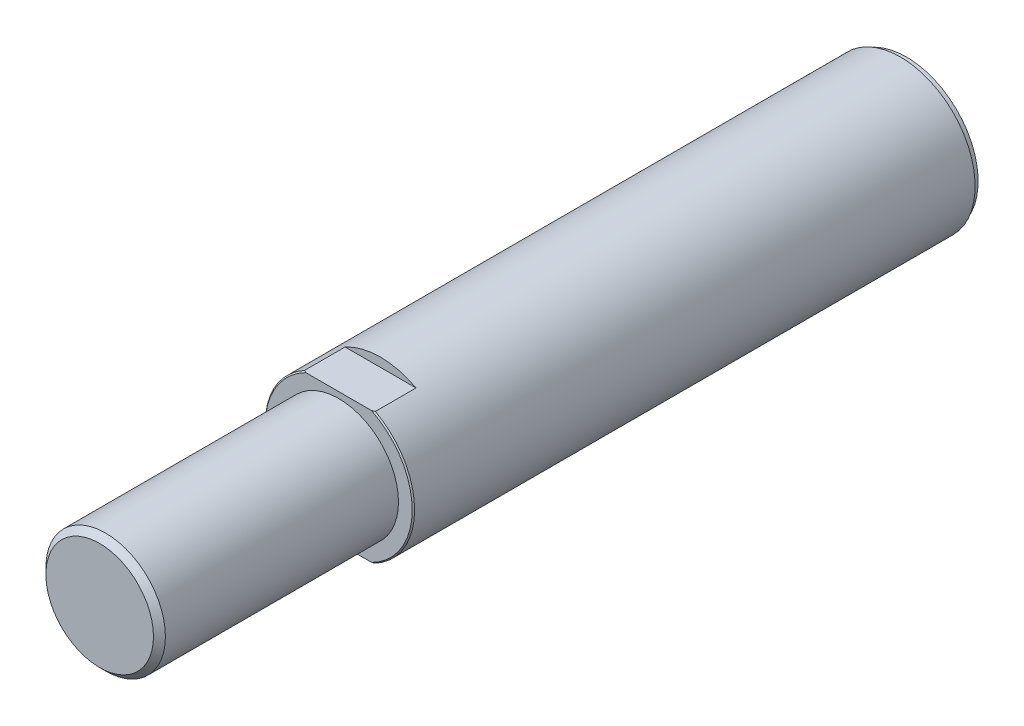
ISO-10303-21;
HEADER;
FILE_DESCRIPTION(('STEP AP214'),'2;1');
FILE_NAME('part.step','',(''),(''),'','','');
FILE_SCHEMA(('AUTOMOTIVE_DESIGN { 1 0 10303 214 1 1 1 1 }'));
ENDSEC;
DATA;
#1=APPLICATION_CONTEXT('core data for automotive mechanical design processes');
#2=APPLICATION_PROTOCOL_DEFINITION('international standard','automotive_design',2000,#1);
#3=PRODUCT_CONTEXT('',#1,'mechanical');
#4=PRODUCT('Part','Part','',(#3));
#5=PRODUCT_RELATED_PRODUCT_CATEGORY('part','',(#4));
#6=PRODUCT_DEFINITION_FORMATION('','',#4);
#7=PRODUCT_DEFINITION_CONTEXT('part definition',#1,'design');
#8=PRODUCT_DEFINITION('design','',#6,#7);
#9=PRODUCT_DEFINITION_SHAPE('','',#8);
#10=(LENGTH_UNIT() NAMED_UNIT(*) SI_UNIT(.MILLI.,.METRE.));
#11=(NAMED_UNIT(*) PLANE_ANGLE_UNIT() SI_UNIT($,.RADIAN.));
#12=(NAMED_UNIT(*) SI_UNIT($,.STERADIAN.) SOLID_ANGLE_UNIT());
#13=UNCERTAINTY_MEASURE_WITH_UNIT(LENGTH_MEASURE(1.E-05),#10,'distance_accuracy_value','');
#14=(GEOMETRIC_REPRESENTATION_CONTEXT(3) GLOBAL_UNCERTAINTY_ASSIGNED_CONTEXT((#13)) GLOBAL_UNIT_ASSIGNED_CONTEXT((#10,
#11,#12)) REPRESENTATION_CONTEXT('',''));
#15=CARTESIAN_POINT('',(0.,0.,0.));
#16=DIRECTION('',(0.,0.,1.));
#17=DIRECTION('',(1.,0.,0.));
#18=AXIS2_PLACEMENT_3D('',#15,#16,#17);
#19=CARTESIAN_POINT('',(0.,0.,135.));
#20=DIRECTION('',(0.,0.,-1.));
#21=DIRECTION('',(-1.,0.,0.));
#22=AXIS2_PLACEMENT_3D('',#19,#20,#21);
#23=CYLINDRICAL_SURFACE('',#22,12.5);
#24=CARTESIAN_POINT('',(0.,0.,1.));
#25=DIRECTION('',(0.,0.,-1.));
#26=DIRECTION('',(-1.,0.,0.));
#27=AXIS2_PLACEMENT_3D('',#24,#25,#26);
#28=CIRCLE('',#27,12.5);
#29=CARTESIAN_POINT('',(-12.5,0.,1.));
#30=VERTEX_POINT('',#29);
#31=EDGE_CURVE('E128',#30,#30,#28,.T.);
#32=ORIENTED_EDGE('',*,*,#31,.F.);
#33=EDGE_LOOP('',(#32));
#34=FACE_BOUND('',#33,.T.);
#35=DIRECTION('',(0.,0.,-1.));
#36=VECTOR('',#35,1.);
#37=CARTESIAN_POINT('',(-5.93717104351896,-11.,135.));
#38=LINE('',#37,#36);
#39=CARTESIAN_POINT('',(-5.93717104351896,-11.,94.8));
#40=VERTEX_POINT('',#39);
#41=CARTESIAN_POINT('',(-5.93717104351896,-11.,88.));
#42=VERTEX_POINT('',#41);
#43=EDGE_CURVE('E199',#40,#42,#38,.T.);
#44=ORIENTED_EDGE('',*,*,#43,.F.);
#45=CARTESIAN_POINT('',(0.,0.,94.8));
#46=DIRECTION('',(0.,0.,1.));
#47=DIRECTION('',(1.,0.,0.));
#48=AXIS2_PLACEMENT_3D('',#45,#46,#47);
#49=CIRCLE('',#48,12.5);
#50=CARTESIAN_POINT('',(-5.93717104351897,11.,94.8));
#51=VERTEX_POINT('',#50);
#52=EDGE_CURVE('E130',#40,#51,#49,.F.);
#53=ORIENTED_EDGE('',*,*,#52,.T.);
#54=DIRECTION('',(0.,0.,-1.));
#55=VECTOR('',#54,1.);
#56=CARTESIAN_POINT('',(-5.93717104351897,11.,135.));
#57=LINE('',#56,#55);
#58=CARTESIAN_POINT('',(-5.93717104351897,11.,88.));
#59=VERTEX_POINT('',#58);
#60=EDGE_CURVE('E57',#59,#51,#57,.F.);
#61=ORIENTED_EDGE('',*,*,#60,.F.);
#62=CARTESIAN_POINT('',(0.,0.,88.));
#63=DIRECTION('',(0.,0.,1.));
#64=DIRECTION('',(1.,0.,0.));
#65=AXIS2_PLACEMENT_3D('',#62,#63,#64);
#66=CIRCLE('',#65,12.5);
#67=CARTESIAN_POINT('',(5.93717104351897,11.,88.));
#68=VERTEX_POINT('',#67);
#69=EDGE_CURVE('E46',#68,#59,#66,.T.);
#70=ORIENTED_EDGE('',*,*,#69,.F.);
#71=DIRECTION('',(0.,0.,-1.));
#72=VECTOR('',#71,1.);
#73=CARTESIAN_POINT('',(5.93717104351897,11.,135.));
#74=LINE('',#73,#72);
#75=CARTESIAN_POINT('',(5.93717104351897,11.,94.8));
#76=VERTEX_POINT('',#75);
#77=EDGE_CURVE('E208',#76,#68,#74,.T.);
#78=ORIENTED_EDGE('',*,*,#77,.F.);
#79=CARTESIAN_POINT('',(5.93717104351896,-11.,94.8));
#80=VERTEX_POINT('',#79);
#81=EDGE_CURVE('E115',#76,#80,#49,.F.);
#82=ORIENTED_EDGE('',*,*,#81,.T.);
#83=DIRECTION('',(0.,0.,-1.));
#84=VECTOR('',#83,1.);
#85=CARTESIAN_POINT('',(5.93717104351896,-11.,135.));
#86=LINE('',#85,#84);
#87=CARTESIAN_POINT('',(5.93717104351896,-11.,88.));
#88=VERTEX_POINT('',#87);
#89=EDGE_CURVE('E65',#88,#80,#86,.F.);
#90=ORIENTED_EDGE('',*,*,#89,.F.);
#91=EDGE_CURVE('E12',#42,#88,#66,.T.);
#92=ORIENTED_EDGE('',*,*,#91,.F.);
#93=EDGE_LOOP('',(#44,#53,#61,#70,#78,#82,#90,#92));
#94=FACE_BOUND('',#93,.T.);
#95=ADVANCED_FACE('F42',(#34,#94),#23,.T.);
#96=CARTESIAN_POINT('',(0.,0.,95.));
#97=DIRECTION('',(0.,0.,1.));
#98=DIRECTION('',(1.,0.,0.));
#99=AXIS2_PLACEMENT_3D('',#96,#97,#98);
#100=PLANE('',#99);
#101=CARTESIAN_POINT('',(0.,0.,95.));
#102=DIRECTION('',(0.,0.,1.));
#103=DIRECTION('',(1.,0.,0.));
#104=AXIS2_PLACEMENT_3D('',#101,#102,#103);
#105=CIRCLE('',#104,10.);
#106=CARTESIAN_POINT('',(10.,0.,95.));
#107=VERTEX_POINT('',#106);
#108=EDGE_CURVE('E121',#107,#107,#105,.T.);
#109=ORIENTED_EDGE('',*,*,#108,.F.);
#110=EDGE_LOOP('',(#109));
#111=FACE_BOUND('',#110,.T.);
#112=CARTESIAN_POINT('',(0.,0.,95.));
#113=DIRECTION('',(0.,0.,1.));
#114=DIRECTION('',(1.,0.,0.));
#115=AXIS2_PLACEMENT_3D('',#112,#113,#114);
#116=CIRCLE('',#115,12.3);
#117=CARTESIAN_POINT('',(-5.50363516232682,11.,95.));
#118=VERTEX_POINT('',#117);
#119=CARTESIAN_POINT('',(-5.50363516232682,-11.,95.));
#120=VERTEX_POINT('',#119);
#121=EDGE_CURVE('E120',#118,#120,#116,.T.);
#122=ORIENTED_EDGE('',*,*,#121,.T.);
#123=DIRECTION('',(1.,0.,0.));
#124=VECTOR('',#123,1.);
#125=CARTESIAN_POINT('',(-21.0914396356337,-11.,95.));
#126=LINE('',#125,#124);
#127=CARTESIAN_POINT('',(5.50363516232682,-11.,95.));
#128=VERTEX_POINT('',#127);
#129=EDGE_CURVE('E107',#120,#128,#126,.T.);
#130=ORIENTED_EDGE('',*,*,#129,.T.);
#131=CARTESIAN_POINT('',(5.50363516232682,11.,95.));
#132=VERTEX_POINT('',#131);
#133=EDGE_CURVE('E113',#128,#132,#116,.T.);
#134=ORIENTED_EDGE('',*,*,#133,.T.);
#135=DIRECTION('',(-1.,0.,0.));
#136=VECTOR('',#135,1.);
#137=CARTESIAN_POINT('',(-21.0914396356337,11.,95.));
#138=LINE('',#137,#136);
#139=EDGE_CURVE('E97',#132,#118,#138,.T.);
#140=ORIENTED_EDGE('',*,*,#139,.T.);
#141=EDGE_LOOP('',(#122,#130,#134,#140));
#142=FACE_BOUND('',#141,.T.);
#143=ADVANCED_FACE('F119',(#111,#142),#100,.T.);
#144=CARTESIAN_POINT('',(0.,0.,95.));
#145=DIRECTION('',(0.,0.,-1.));
#146=DIRECTION('',(-1.,0.,0.));
#147=AXIS2_PLACEMENT_3D('',#144,#145,#146);
#148=CONICAL_SURFACE('',#147,12.3,0.785398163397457);
#149=ORIENTED_EDGE('',*,*,#52,.F.);
#150=CARTESIAN_POINT('',(-25.2049082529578,-11.,79.7993200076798));
#151=CARTESIAN_POINT('',(-24.8332961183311,-11.,80.1398994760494));
#152=CARTESIAN_POINT('',(-24.4610927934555,-11.,80.4798355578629));
#153=CARTESIAN_POINT('',(-23.7153278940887,-11.,81.1582204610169));
#154=CARTESIAN_POINT('',(-23.3417663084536,-11.,81.4966692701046));
#155=CARTESIAN_POINT('',(-22.5930262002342,-11.,82.1719537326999));
#156=CARTESIAN_POINT('',(-22.2178473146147,-11.,82.5087889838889));
#157=CARTESIAN_POINT('',(-21.4657494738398,-11.,83.1805104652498));
#158=CARTESIAN_POINT('',(-21.0888305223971,-11.,83.5153966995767));
#159=CARTESIAN_POINT('',(-20.3305063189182,-11.,84.185120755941));
#160=CARTESIAN_POINT('',(-19.9490878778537,-11.,84.5199436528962));
#161=CARTESIAN_POINT('',(-19.1839299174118,-11.,85.1869267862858));
#162=CARTESIAN_POINT('',(-18.8001904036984,-11.,85.5190870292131));
#163=CARTESIAN_POINT('',(-18.0300668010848,-11.,86.1802387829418));
#164=CARTESIAN_POINT('',(-17.6436830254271,-11.,86.509230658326));
#165=CARTESIAN_POINT('',(-16.8677829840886,-11.,87.1635010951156));
#166=CARTESIAN_POINT('',(-16.4782667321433,-11.,87.4887796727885));
#167=CARTESIAN_POINT('',(-15.7614675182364,-11.,88.0804751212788));
#168=CARTESIAN_POINT('',(-15.4347519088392,-11.,88.3475789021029));
#169=CARTESIAN_POINT('',(-14.7783997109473,-11.,88.878171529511));
#170=CARTESIAN_POINT('',(-14.4487631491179,-11.,89.1416604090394));
#171=CARTESIAN_POINT('',(-13.7860202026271,-11.,89.6644435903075));
#172=CARTESIAN_POINT('',(-13.4529128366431,-11.,89.9237366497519));
#173=CARTESIAN_POINT('',(-12.7827870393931,-11.,90.4372220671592));
#174=CARTESIAN_POINT('',(-12.4457686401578,-11.,90.6914144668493));
#175=CARTESIAN_POINT('',(-11.7675925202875,-11.,91.1933465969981));
#176=CARTESIAN_POINT('',(-11.4264404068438,-11.,91.4410938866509));
#177=CARTESIAN_POINT('',(-10.738811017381,-11.,91.9291387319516));
#178=CARTESIAN_POINT('',(-10.3923335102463,-11.,92.1694359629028));
#179=CARTESIAN_POINT('',(-9.69333013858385,-11.,92.6407355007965));
#180=CARTESIAN_POINT('',(-9.34080722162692,-11.,92.8717421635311));
#181=CARTESIAN_POINT('',(-8.6285494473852,-11.,93.3223116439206));
#182=CARTESIAN_POINT('',(-8.26881550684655,-11.,93.5418759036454));
#183=CARTESIAN_POINT('',(-7.54622405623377,-11.,93.9635589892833));
#184=CARTESIAN_POINT('',(-7.1834883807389,-11.,94.1658853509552));
#185=CARTESIAN_POINT('',(-6.4486276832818,-11.,94.5529518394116));
#186=CARTESIAN_POINT('',(-6.07650171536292,-11.,94.7376901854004));
#187=CARTESIAN_POINT('',(-5.32234700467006,-11.,95.0846232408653));
#188=CARTESIAN_POINT('',(-4.94033118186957,-11.,95.2468457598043));
#189=CARTESIAN_POINT('',(-4.16548005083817,-11.,95.5431605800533));
#190=CARTESIAN_POINT('',(-3.77264786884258,-11.,95.6772609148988));
#191=CARTESIAN_POINT('',(-3.05749092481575,-11.,95.8870100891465));
#192=CARTESIAN_POINT('',(-2.73703620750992,-11.,95.9689982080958));
#193=CARTESIAN_POINT('',(-2.09063675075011,-11.,96.1075378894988));
#194=CARTESIAN_POINT('',(-1.76469277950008,-11.,96.1640929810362));
#195=CARTESIAN_POINT('',(-1.10994339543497,-11.,96.2488943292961));
#196=CARTESIAN_POINT('',(-0.781147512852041,-11.,96.2772131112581));
#197=CARTESIAN_POINT('',(-0.122326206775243,-11.,96.3042432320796));
#198=CARTESIAN_POINT('',(0.207699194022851,-11.,96.3029551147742));
#199=CARTESIAN_POINT('',(0.866187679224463,-11.,96.2708506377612));
#200=CARTESIAN_POINT('',(1.19465120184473,-11.,96.2400431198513));
#201=CARTESIAN_POINT('',(1.8477342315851,-11.,96.1505870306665));
#202=CARTESIAN_POINT('',(2.17235340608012,-11.,96.0919360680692));
#203=CARTESIAN_POINT('',(2.81692746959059,-11.,95.9494087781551));
#204=CARTESIAN_POINT('',(3.13686596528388,-11.,95.8654592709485));
#205=CARTESIAN_POINT('',(3.77013120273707,-11.,95.6757764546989));
#206=CARTESIAN_POINT('',(4.08345803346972,-11.,95.5700434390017));
#207=CARTESIAN_POINT('',(4.77959899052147,-11.,95.3118471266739));
#208=CARTESIAN_POINT('',(5.16051287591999,-11.,95.1542887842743));
#209=CARTESIAN_POINT('',(5.9121721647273,-11.,94.8163719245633));
#210=CARTESIAN_POINT('',(6.28291247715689,-11.,94.636002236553));
#211=CARTESIAN_POINT('',(7.01572159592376,-11.,94.2569234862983));
#212=CARTESIAN_POINT('',(7.37777248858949,-11.,94.0581800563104));
#213=CARTESIAN_POINT('',(8.09354374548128,-11.,93.6464369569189));
#214=CARTESIAN_POINT('',(8.44726541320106,-11.,93.4334395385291));
#215=CARTESIAN_POINT('',(9.15130038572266,-11.,92.9937098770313));
#216=CARTESIAN_POINT('',(9.50153682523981,-11.,92.7668551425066));
#217=CARTESIAN_POINT('',(10.1957742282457,-11.,92.3037685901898));
#218=CARTESIAN_POINT('',(10.5397746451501,-11.,92.0675359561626));
#219=CARTESIAN_POINT('',(11.2225281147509,-11.,91.5873865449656));
#220=CARTESIAN_POINT('',(11.5612793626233,-11.,91.3434672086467));
#221=CARTESIAN_POINT('',(12.2341678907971,-11.,90.8493837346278));
#222=CARTESIAN_POINT('',(12.5683053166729,-11.,90.5992197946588));
#223=CARTESIAN_POINT('',(13.449124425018,-11.,89.928993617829));
#224=CARTESIAN_POINT('',(13.9924028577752,-11.,89.5044606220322));
#225=CARTESIAN_POINT('',(15.0704026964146,-11.,88.6449335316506));
#226=CARTESIAN_POINT('',(15.6051257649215,-11.,88.2099415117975));
#227=CARTESIAN_POINT('',(16.6682135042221,-11.,87.3315328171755));
#228=CARTESIAN_POINT('',(17.196573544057,-11.,86.8881105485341));
#229=CARTESIAN_POINT('',(18.2478896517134,-11.,85.9948668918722));
#230=CARTESIAN_POINT('',(18.7708454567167,-11.,85.5450451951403));
#231=CARTESIAN_POINT('',(19.7911752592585,-11.,84.6586787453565));
#232=CARTESIAN_POINT('',(20.2887256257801,-11.,84.222336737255));
#233=CARTESIAN_POINT('',(21.2804238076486,-11.,83.3458210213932));
#234=CARTESIAN_POINT('',(21.7745716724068,-11.,82.9056473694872));
#235=CARTESIAN_POINT('',(22.7594616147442,-11.,82.0226290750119));
#236=CARTESIAN_POINT('',(23.250206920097,-11.,81.5797880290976));
#237=CARTESIAN_POINT('',(24.2292721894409,-11.,80.6914346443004));
#238=CARTESIAN_POINT('',(24.7175921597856,-11.,80.2459223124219));
#239=CARTESIAN_POINT('',(25.2049082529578,-11.,79.7993200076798));
#240=B_SPLINE_CURVE_WITH_KNOTS('',3,(#150,#151,#152,#153,#154,#155,#156,#157,#158,#159,#160,
#161,#162,#163,#164,#165,#166,#167,#168,#169,#170,#171,#172,#173,#174,#175,#176,#177,#178,#179,
#180,#181,#182,#183,#184,#185,#186,#187,#188,#189,#190,#191,#192,#193,#194,#195,#196,#197,#198,
#199,#200,#201,#202,#203,#204,#205,#206,#207,#208,#209,#210,#211,#212,#213,#214,#215,#216,#217,
#218,#219,#220,#221,#222,#223,#224,#225,#226,#227,#228,#229,#230,#231,#232,#233,#234,#235,#236,
#237,#238,#239),.UNSPECIFIED.,.F.,.F.,(4,2,2,2,2,2,2,2,2,2,2,2,2,2,2,2,2,2,2,2,2,2,2,2,2,2,2,2,
2,2,2,2,2,2,2,2,2,2,2,2,2,2,2,2,4),(0.,1.51222100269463,3.0244544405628,4.53704712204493,
6.04963657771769,7.57221518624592,9.09479008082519,10.6171876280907,12.1395785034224,
13.4055696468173,14.6715492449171,15.9378970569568,17.2042345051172,18.4690128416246,
19.7338462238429,20.9980795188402,22.2621530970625,23.5078130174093,24.7535989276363,
25.9978321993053,27.2417095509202,28.2331520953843,29.2244570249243,30.213209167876,
31.2019431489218,32.1903810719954,33.178903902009,34.1703140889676,35.1617109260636,
36.3973752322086,37.6336470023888,38.8722798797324,40.1107176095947,41.3623951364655,
42.6141818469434,43.8663898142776,45.1185581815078,47.1867976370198,49.254630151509,
51.3238862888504,53.3932425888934,55.3785544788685,57.3638374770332,59.3468682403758,
61.3298938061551),.UNSPECIFIED.);
#241=EDGE_CURVE('E206',#40,#120,#240,.T.);
#242=ORIENTED_EDGE('',*,*,#241,.T.);
#243=ORIENTED_EDGE('',*,*,#121,.F.);
#244=CARTESIAN_POINT('',(25.2049082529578,11.,79.7993200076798));
#245=CARTESIAN_POINT('',(24.8332961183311,11.,80.1398994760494));
#246=CARTESIAN_POINT('',(24.4610927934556,11.,80.4798355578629));
#247=CARTESIAN_POINT('',(23.7153278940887,11.,81.1582204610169));
#248=CARTESIAN_POINT('',(23.3417663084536,11.,81.4966692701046));
#249=CARTESIAN_POINT('',(22.5930262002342,11.,82.1719537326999));
#250=CARTESIAN_POINT('',(22.2178473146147,11.,82.5087889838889));
#251=CARTESIAN_POINT('',(21.4657494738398,11.,83.1805104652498));
#252=CARTESIAN_POINT('',(21.0888305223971,11.,83.5153966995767));
#253=CARTESIAN_POINT('',(20.3305063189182,11.,84.185120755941));
#254=CARTESIAN_POINT('',(19.9490878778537,11.,84.5199436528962));
#255=CARTESIAN_POINT('',(19.1839299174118,11.,85.1869267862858));
#256=CARTESIAN_POINT('',(18.8001904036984,11.,85.5190870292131));
#257=CARTESIAN_POINT('',(18.0300668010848,11.,86.1802387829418));
#258=CARTESIAN_POINT('',(17.6436830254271,11.,86.509230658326));
#259=CARTESIAN_POINT('',(16.8677829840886,11.,87.1635010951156));
#260=CARTESIAN_POINT('',(16.4782667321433,11.,87.4887796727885));
#261=CARTESIAN_POINT('',(15.7614675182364,11.,88.0804751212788));
#262=CARTESIAN_POINT('',(15.4347519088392,11.,88.3475789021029));
#263=CARTESIAN_POINT('',(14.7783997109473,11.,88.878171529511));
#264=CARTESIAN_POINT('',(14.4487631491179,11.,89.1416604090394));
#265=CARTESIAN_POINT('',(13.7860202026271,11.,89.6644435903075));
#266=CARTESIAN_POINT('',(13.4529128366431,11.,89.9237366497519));
#267=CARTESIAN_POINT('',(12.7827870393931,11.,90.4372220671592));
#268=CARTESIAN_POINT('',(12.4457686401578,11.,90.6914144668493));
#269=CARTESIAN_POINT('',(11.7675925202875,11.,91.1933465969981));
#270=CARTESIAN_POINT('',(11.4264404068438,11.,91.4410938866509));
#271=CARTESIAN_POINT('',(10.738811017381,11.,91.9291387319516));
#272=CARTESIAN_POINT('',(10.3923335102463,11.,92.1694359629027));
#273=CARTESIAN_POINT('',(9.69333013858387,11.,92.6407355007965));
#274=CARTESIAN_POINT('',(9.34080722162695,11.,92.8717421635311));
#275=CARTESIAN_POINT('',(8.62854944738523,11.,93.3223116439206));
#276=CARTESIAN_POINT('',(8.26881550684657,11.,93.5418759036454));
#277=CARTESIAN_POINT('',(7.5462240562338,11.,93.9635589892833));
#278=CARTESIAN_POINT('',(7.18348838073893,11.,94.1658853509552));
#279=CARTESIAN_POINT('',(6.44862768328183,11.,94.5529518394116));
#280=CARTESIAN_POINT('',(6.07650171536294,11.,94.7376901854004));
#281=CARTESIAN_POINT('',(5.32234700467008,11.,95.0846232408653));
#282=CARTESIAN_POINT('',(4.94033118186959,11.,95.2468457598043));
#283=CARTESIAN_POINT('',(4.16548005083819,11.,95.5431605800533));
#284=CARTESIAN_POINT('',(3.77264786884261,11.,95.6772609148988));
#285=CARTESIAN_POINT('',(3.05749092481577,11.,95.8870100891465));
#286=CARTESIAN_POINT('',(2.73703620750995,11.,95.9689982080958));
#287=CARTESIAN_POINT('',(2.09063675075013,11.,96.1075378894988));
#288=CARTESIAN_POINT('',(1.7646927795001,11.,96.1640929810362));
#289=CARTESIAN_POINT('',(1.10994339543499,11.,96.2488943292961));
#290=CARTESIAN_POINT('',(0.781147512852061,11.,96.2772131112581));
#291=CARTESIAN_POINT('',(0.12232620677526,11.,96.3042432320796));
#292=CARTESIAN_POINT('',(-0.207699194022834,11.,96.3029551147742));
#293=CARTESIAN_POINT('',(-0.866187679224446,11.,96.2708506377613));
#294=CARTESIAN_POINT('',(-1.19465120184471,11.,96.2400431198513));
#295=CARTESIAN_POINT('',(-1.84773423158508,11.,96.1505870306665));
#296=CARTESIAN_POINT('',(-2.1723534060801,11.,96.0919360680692));
#297=CARTESIAN_POINT('',(-2.81692746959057,11.,95.9494087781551));
#298=CARTESIAN_POINT('',(-3.13686596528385,11.,95.8654592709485));
#299=CARTESIAN_POINT('',(-3.77013120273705,11.,95.6757764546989));
#300=CARTESIAN_POINT('',(-4.08345803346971,11.,95.5700434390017));
#301=CARTESIAN_POINT('',(-4.77959899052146,11.,95.3118471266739));
#302=CARTESIAN_POINT('',(-5.16051287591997,11.,95.1542887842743));
#303=CARTESIAN_POINT('',(-5.91217216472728,11.,94.8163719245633));
#304=CARTESIAN_POINT('',(-6.28291247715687,11.,94.636002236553));
#305=CARTESIAN_POINT('',(-7.01572159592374,11.,94.2569234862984));
#306=CARTESIAN_POINT('',(-7.37777248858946,11.,94.0581800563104));
#307=CARTESIAN_POINT('',(-8.09354374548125,11.,93.6464369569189));
#308=CARTESIAN_POINT('',(-8.44726541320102,11.,93.4334395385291));
#309=CARTESIAN_POINT('',(-9.15130038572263,11.,92.9937098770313));
#310=CARTESIAN_POINT('',(-9.50153682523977,11.,92.7668551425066));
#311=CARTESIAN_POINT('',(-10.1957742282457,11.,92.3037685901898));
#312=CARTESIAN_POINT('',(-10.5397746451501,11.,92.0675359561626));
#313=CARTESIAN_POINT('',(-11.2225281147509,11.,91.5873865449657));
#314=CARTESIAN_POINT('',(-11.5612793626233,11.,91.3434672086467));
#315=CARTESIAN_POINT('',(-12.2341678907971,11.,90.8493837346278));
#316=CARTESIAN_POINT('',(-12.5683053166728,11.,90.5992197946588));
#317=CARTESIAN_POINT('',(-13.449124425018,11.,89.928993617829));
#318=CARTESIAN_POINT('',(-13.9924028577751,11.,89.5044606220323));
#319=CARTESIAN_POINT('',(-15.0704026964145,11.,88.6449335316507));
#320=CARTESIAN_POINT('',(-15.6051257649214,11.,88.2099415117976));
#321=CARTESIAN_POINT('',(-16.6682135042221,11.,87.3315328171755));
#322=CARTESIAN_POINT('',(-17.196573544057,11.,86.8881105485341));
#323=CARTESIAN_POINT('',(-18.2478896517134,11.,85.9948668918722));
#324=CARTESIAN_POINT('',(-18.7708454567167,11.,85.5450451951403));
#325=CARTESIAN_POINT('',(-19.7911752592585,11.,84.6586787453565));
#326=CARTESIAN_POINT('',(-20.2887256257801,11.,84.222336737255));
#327=CARTESIAN_POINT('',(-21.2804238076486,11.,83.3458210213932));
#328=CARTESIAN_POINT('',(-21.7745716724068,11.,82.9056473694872));
#329=CARTESIAN_POINT('',(-22.7594616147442,11.,82.0226290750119));
#330=CARTESIAN_POINT('',(-23.250206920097,11.,81.5797880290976));
#331=CARTESIAN_POINT('',(-24.2292721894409,11.,80.6914346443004));
#332=CARTESIAN_POINT('',(-24.7175921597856,11.,80.2459223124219));
#333=CARTESIAN_POINT('',(-25.2049082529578,11.,79.7993200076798));
#334=B_SPLINE_CURVE_WITH_KNOTS('',3,(#244,#245,#246,#247,#248,#249,#250,#251,#252,#253,#254,
#255,#256,#257,#258,#259,#260,#261,#262,#263,#264,#265,#266,#267,#268,#269,#270,#271,#272,#273,
#274,#275,#276,#277,#278,#279,#280,#281,#282,#283,#284,#285,#286,#287,#288,#289,#290,#291,#292,
#293,#294,#295,#296,#297,#298,#299,#300,#301,#302,#303,#304,#305,#306,#307,#308,#309,#310,#311,
#312,#313,#314,#315,#316,#317,#318,#319,#320,#321,#322,#323,#324,#325,#326,#327,#328,#329,#330,
#331,#332,#333),.UNSPECIFIED.,.F.,.F.,(4,2,2,2,2,2,2,2,2,2,2,2,2,2,2,2,2,2,2,2,2,2,2,2,2,2,2,2,
2,2,2,2,2,2,2,2,2,2,2,2,2,2,2,2,4),(0.,1.51222100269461,3.02445444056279,4.53704712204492,
6.04963657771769,7.5722151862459,9.09479008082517,10.6171876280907,12.1395785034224,
13.4055696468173,14.6715492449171,15.9378970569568,17.2042345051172,18.4690128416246,
19.7338462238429,20.9980795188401,22.2621530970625,23.5078130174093,24.7535989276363,
25.9978321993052,27.2417095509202,28.2331520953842,29.2244570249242,30.213209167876,
31.2019431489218,32.1903810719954,33.178903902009,34.1703140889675,35.1617109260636,
36.3973752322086,37.6336470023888,38.8722798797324,40.1107176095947,41.3623951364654,
42.6141818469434,43.8663898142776,45.1185581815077,47.1867976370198,49.254630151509,
51.3238862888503,53.3932425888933,55.3785544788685,57.3638374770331,59.3468682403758,
61.3298938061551),.UNSPECIFIED.);
#335=EDGE_CURVE('E102',#118,#51,#334,.T.);
#336=ORIENTED_EDGE('',*,*,#335,.T.);
#337=EDGE_LOOP('',(#149,#242,#243,#336));
#338=FACE_BOUND('',#337,.T.);
#339=ADVANCED_FACE('F146',(#338),#148,.T.);
#340=ORIENTED_EDGE('',*,*,#133,.F.);
#341=EDGE_CURVE('E116',#128,#80,#240,.T.);
#342=ORIENTED_EDGE('',*,*,#341,.T.);
#343=ORIENTED_EDGE('',*,*,#81,.F.);
#344=EDGE_CURVE('E100',#76,#132,#334,.T.);
#345=ORIENTED_EDGE('',*,*,#344,.T.);
#346=EDGE_LOOP('',(#340,#342,#343,#345));
#347=FACE_BOUND('',#346,.T.);
#348=ADVANCED_FACE('F112',(#347),#148,.T.);
#349=CARTESIAN_POINT('',(0.,0.,95.));
#350=DIRECTION('',(0.,0.,1.));
#351=DIRECTION('',(1.,0.,0.));
#352=AXIS2_PLACEMENT_3D('',#349,#350,#351);
#353=CYLINDRICAL_SURFACE('',#352,10.);
#354=CARTESIAN_POINT('',(0.,0.,134.));
#355=DIRECTION('',(0.,0.,1.));
#356=DIRECTION('',(1.,0.,0.));
#357=AXIS2_PLACEMENT_3D('',#354,#355,#356);
#358=CIRCLE('',#357,10.);
#359=CARTESIAN_POINT('',(10.,0.,134.));
#360=VERTEX_POINT('',#359);
#361=EDGE_CURVE('E134',#360,#360,#358,.F.);
#362=ORIENTED_EDGE('',*,*,#361,.T.);
#363=EDGE_LOOP('',(#362));
#364=FACE_BOUND('',#363,.T.);
#365=ORIENTED_EDGE('',*,*,#108,.T.);
#366=EDGE_LOOP('',(#365));
#367=FACE_BOUND('',#366,.T.);
#368=ADVANCED_FACE('F177',(#364,#367),#353,.T.);
#369=CARTESIAN_POINT('',(0.,0.,135.));
#370=DIRECTION('',(0.,0.,1.));
#371=DIRECTION('',(1.,0.,0.));
#372=AXIS2_PLACEMENT_3D('',#369,#370,#371);
#373=PLANE('',#372);
#374=CARTESIAN_POINT('',(0.,0.,135.));
#375=DIRECTION('',(0.,0.,1.));
#376=DIRECTION('',(1.,0.,0.));
#377=AXIS2_PLACEMENT_3D('',#374,#375,#376);
#378=CIRCLE('',#377,8.99999999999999);
#379=CARTESIAN_POINT('',(8.99999999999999,0.,135.));
#380=VERTEX_POINT('',#379);
#381=EDGE_CURVE('E131',#380,#380,#378,.T.);
#382=ORIENTED_EDGE('',*,*,#381,.T.);
#383=EDGE_LOOP('',(#382));
#384=FACE_BOUND('',#383,.T.);
#385=ADVANCED_FACE('F167',(#384),#373,.T.);
#386=CARTESIAN_POINT('',(0.,0.,1.));
#387=DIRECTION('',(0.,0.,-1.));
#388=DIRECTION('',(-1.,0.,0.));
#389=AXIS2_PLACEMENT_3D('',#386,#387,#388);
#390=PLANE('',#389);
#391=CARTESIAN_POINT('',(0.,0.,1.));
#392=DIRECTION('',(0.,0.,-1.));
#393=DIRECTION('',(-1.,0.,0.));
#394=AXIS2_PLACEMENT_3D('',#391,#392,#393);
#395=CIRCLE('',#394,12.);
#396=CARTESIAN_POINT('',(-12.,0.,1.));
#397=VERTEX_POINT('',#396);
#398=EDGE_CURVE('E216',#397,#397,#395,.T.);
#399=ORIENTED_EDGE('',*,*,#398,.F.);
#400=EDGE_LOOP('',(#399));
#401=FACE_BOUND('',#400,.T.);
#402=ORIENTED_EDGE('',*,*,#31,.T.);
#403=EDGE_LOOP('',(#402));
#404=FACE_BOUND('',#403,.T.);
#405=ADVANCED_FACE('F163',(#401,#404),#390,.T.);
#406=CARTESIAN_POINT('',(0.,0.,1.));
#407=DIRECTION('',(0.,0.,-1.));
#408=DIRECTION('',(-1.,0.,0.));
#409=AXIS2_PLACEMENT_3D('',#406,#407,#408);
#410=CYLINDRICAL_SURFACE('',#409,12.);
#411=ORIENTED_EDGE('',*,*,#398,.T.);
#412=EDGE_LOOP('',(#411));
#413=FACE_BOUND('',#412,.T.);
#414=CARTESIAN_POINT('',(0.,0.,0.));
#415=DIRECTION('',(0.,0.,-1.));
#416=DIRECTION('',(-1.,0.,0.));
#417=AXIS2_PLACEMENT_3D('',#414,#415,#416);
#418=CIRCLE('',#417,12.);
#419=CARTESIAN_POINT('',(-12.,0.,0.));
#420=VERTEX_POINT('',#419);
#421=EDGE_CURVE('E202',#420,#420,#418,.T.);
#422=ORIENTED_EDGE('',*,*,#421,.F.);
#423=EDGE_LOOP('',(#422));
#424=FACE_BOUND('',#423,.T.);
#425=ADVANCED_FACE('F159',(#413,#424),#410,.T.);
#426=CARTESIAN_POINT('',(0.,0.,32.75));
#427=DIRECTION('',(0.,0.,-1.));
#428=DIRECTION('',(-1.,0.,0.));
#429=AXIS2_PLACEMENT_3D('',#426,#427,#428);
#430=CONICAL_SURFACE('',#429,5.09999999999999,1.02974425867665);
#431=CARTESIAN_POINT('',(0.,0.,35.8143891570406));
#432=VERTEX_POINT('',#431);
#433=VERTEX_LOOP('',#432);
#434=FACE_BOUND('',#433,.T.);
#435=CARTESIAN_POINT('',(0.,0.,32.75));
#436=DIRECTION('',(0.,0.,-1.));
#437=DIRECTION('',(-1.,0.,0.));
#438=AXIS2_PLACEMENT_3D('',#435,#436,#437);
#439=CIRCLE('',#438,5.09999999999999);
#440=CARTESIAN_POINT('',(-5.09999999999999,0.,32.75));
#441=VERTEX_POINT('',#440);
#442=EDGE_CURVE('E124',#441,#441,#439,.T.);
#443=ORIENTED_EDGE('',*,*,#442,.T.);
#444=EDGE_LOOP('',(#443));
#445=FACE_BOUND('',#444,.T.);
#446=ADVANCED_FACE('F162',(#434,#445),#430,.F.);
#447=CARTESIAN_POINT('',(0.,0.,0.));
#448=DIRECTION('',(0.,0.,-1.));
#449=DIRECTION('',(-1.,0.,0.));
#450=AXIS2_PLACEMENT_3D('',#447,#448,#449);
#451=CYLINDRICAL_SURFACE('',#450,5.09999999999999);
#452=ORIENTED_EDGE('',*,*,#442,.F.);
#453=EDGE_LOOP('',(#452));
#454=FACE_BOUND('',#453,.T.);
#455=CARTESIAN_POINT('',(0.,0.,0.));
#456=DIRECTION('',(0.,0.,-1.));
#457=DIRECTION('',(-1.,0.,0.));
#458=AXIS2_PLACEMENT_3D('',#455,#456,#457);
#459=CIRCLE('',#458,5.1);
#460=CARTESIAN_POINT('',(-5.1,0.,0.));
#461=VERTEX_POINT('',#460);
#462=EDGE_CURVE('E221',#461,#461,#459,.T.);
#463=ORIENTED_EDGE('',*,*,#462,.T.);
#464=EDGE_LOOP('',(#463));
#465=FACE_BOUND('',#464,.T.);
#466=ADVANCED_FACE('F169',(#454,#465),#451,.F.);
#467=CARTESIAN_POINT('',(0.,0.,0.));
#468=DIRECTION('',(0.,0.,1.));
#469=DIRECTION('',(1.,0.,0.));
#470=AXIS2_PLACEMENT_3D('',#467,#468,#469);
#471=PLANE('',#470);
#472=ORIENTED_EDGE('',*,*,#462,.F.);
#473=EDGE_LOOP('',(#472));
#474=FACE_BOUND('',#473,.T.);
#475=ORIENTED_EDGE('',*,*,#421,.T.);
#476=EDGE_LOOP('',(#475));
#477=FACE_BOUND('',#476,.T.);
#478=ADVANCED_FACE('F172',(#474,#477),#471,.F.);
#479=CARTESIAN_POINT('',(0.,0.,135.));
#480=DIRECTION('',(0.,0.,-1.));
#481=DIRECTION('',(-1.,0.,0.));
#482=AXIS2_PLACEMENT_3D('',#479,#480,#481);
#483=CONICAL_SURFACE('',#482,8.99999999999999,0.785398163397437);
#484=ORIENTED_EDGE('',*,*,#361,.F.);
#485=EDGE_LOOP('',(#484));
#486=FACE_BOUND('',#485,.T.);
#487=ORIENTED_EDGE('',*,*,#381,.F.);
#488=EDGE_LOOP('',(#487));
#489=FACE_BOUND('',#488,.T.);
#490=ADVANCED_FACE('F44',(#486,#489),#483,.T.);
#491=CARTESIAN_POINT('',(-21.0914396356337,11.,88.));
#492=DIRECTION('',(0.,1.,0.));
#493=DIRECTION('',(0.,0.,1.));
#494=AXIS2_PLACEMENT_3D('',#491,#492,#493);
#495=PLANE('',#494);
#496=ORIENTED_EDGE('',*,*,#77,.T.);
#497=DIRECTION('',(-1.,0.,0.));
#498=VECTOR('',#497,1.);
#499=CARTESIAN_POINT('',(-21.0914396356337,11.,88.));
#500=LINE('',#499,#498);
#501=EDGE_CURVE('E234',#68,#59,#500,.T.);
#502=ORIENTED_EDGE('',*,*,#501,.T.);
#503=ORIENTED_EDGE('',*,*,#60,.T.);
#504=ORIENTED_EDGE('',*,*,#335,.F.);
#505=ORIENTED_EDGE('',*,*,#139,.F.);
#506=ORIENTED_EDGE('',*,*,#344,.F.);
#507=EDGE_LOOP('',(#496,#502,#503,#504,#505,#506));
#508=FACE_BOUND('',#507,.T.);
#509=ADVANCED_FACE('F99',(#508),#495,.T.);
#510=CARTESIAN_POINT('',(0.,0.,88.));
#511=DIRECTION('',(0.,0.,1.));
#512=DIRECTION('',(1.,0.,0.));
#513=AXIS2_PLACEMENT_3D('',#510,#511,#512);
#514=PLANE('',#513);
#515=ORIENTED_EDGE('',*,*,#69,.T.);
#516=ORIENTED_EDGE('',*,*,#501,.F.);
#517=EDGE_LOOP('',(#515,#516));
#518=FACE_BOUND('',#517,.T.);
#519=ADVANCED_FACE('F152',(#518),#514,.T.);
#520=ORIENTED_EDGE('',*,*,#91,.T.);
#521=DIRECTION('',(1.,0.,0.));
#522=VECTOR('',#521,1.);
#523=CARTESIAN_POINT('',(-21.0914396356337,-11.,88.));
#524=LINE('',#523,#522);
#525=EDGE_CURVE('E212',#42,#88,#524,.T.);
#526=ORIENTED_EDGE('',*,*,#525,.F.);
#527=EDGE_LOOP('',(#520,#526));
#528=FACE_BOUND('',#527,.T.);
#529=ADVANCED_FACE('F157',(#528),#514,.T.);
#530=CARTESIAN_POINT('',(-21.0914396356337,-11.,88.));
#531=DIRECTION('',(0.,-1.,0.));
#532=DIRECTION('',(0.,0.,-1.));
#533=AXIS2_PLACEMENT_3D('',#530,#531,#532);
#534=PLANE('',#533);
#535=ORIENTED_EDGE('',*,*,#43,.T.);
#536=ORIENTED_EDGE('',*,*,#525,.T.);
#537=ORIENTED_EDGE('',*,*,#89,.T.);
#538=ORIENTED_EDGE('',*,*,#341,.F.);
#539=ORIENTED_EDGE('',*,*,#129,.F.);
#540=ORIENTED_EDGE('',*,*,#241,.F.);
#541=EDGE_LOOP('',(#535,#536,#537,#538,#539,#540));
#542=FACE_BOUND('',#541,.T.);
#543=ADVANCED_FACE('F153',(#542),#534,.T.);
#544=CLOSED_SHELL('',(#95,#143,#339,#348,#368,#385,#405,#425,#446,#466,#478,#490,#509,#519,#529,#543));
#545=MANIFOLD_SOLID_BREP('B2',#544);
#546=ADVANCED_BREP_SHAPE_REPRESENTATION('',(#18,#545),#14);
#547=SHAPE_DEFINITION_REPRESENTATION(#9,#546);
ENDSEC;
END-ISO-10303-21;
